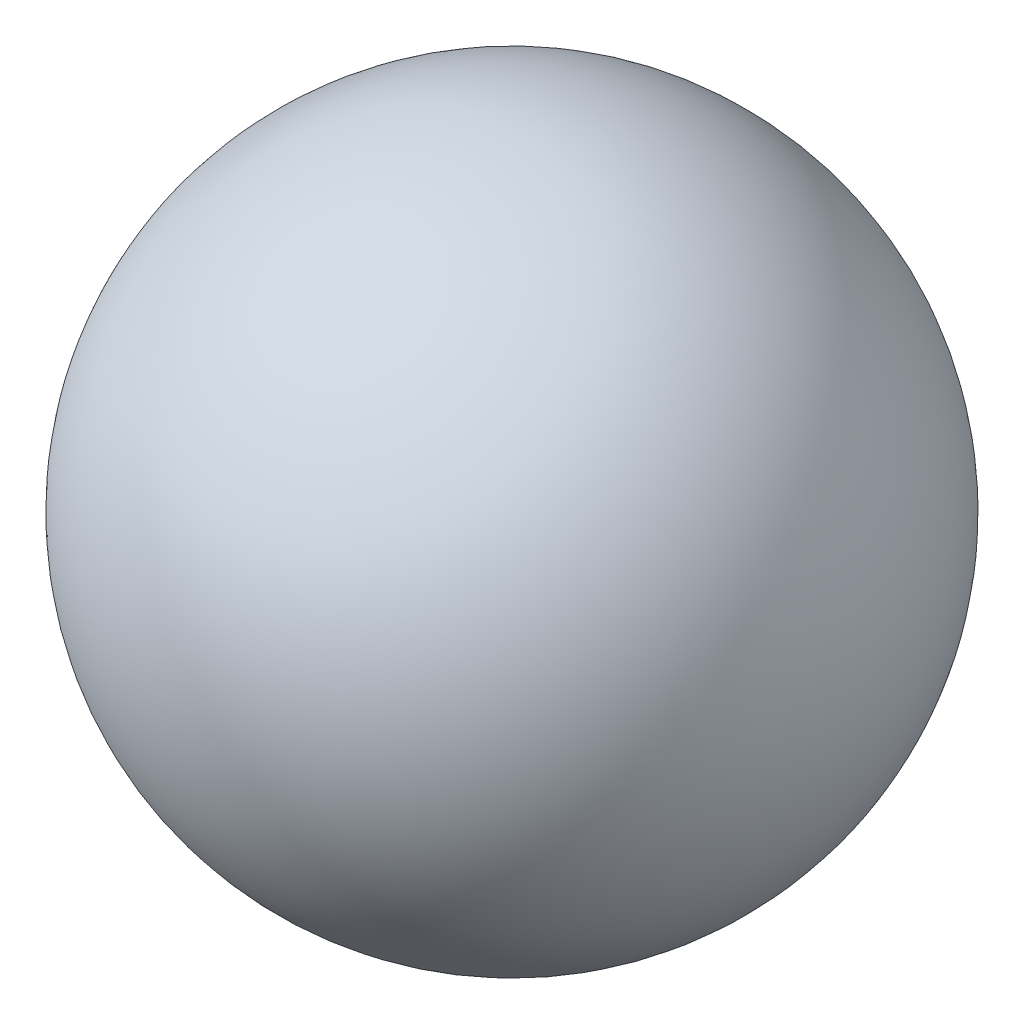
from build123d import *


with BuildPart() as part:
    # Esquisse1 → Base-R_volution (revolve)
    with BuildSketch(Plane.XY):
        with BuildLine():
            Line((-4.75, 0), (4.75, 0))
            ThreePointArc((4.75, 0), (0, 4.75), (-4.75, 0))
        make_face()
    revolve(axis=Axis((-6.431915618, 0, 0), (1, 0, 0)))


solid = part.part
